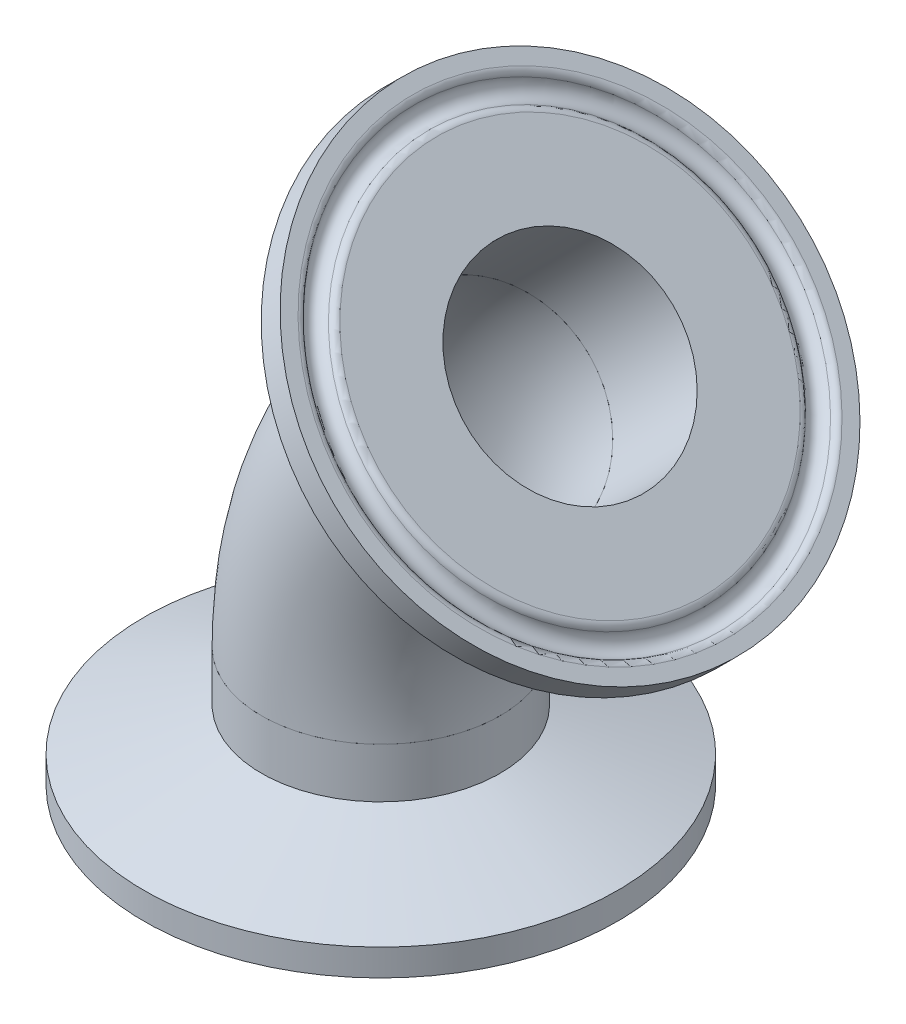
ISO-10303-21;
HEADER;
FILE_DESCRIPTION(('STEP AP214'),'2;1');
FILE_NAME('part.step','',(''),(''),'','','');
FILE_SCHEMA(('AUTOMOTIVE_DESIGN { 1 0 10303 214 1 1 1 1 }'));
ENDSEC;
DATA;
#1=APPLICATION_CONTEXT('core data for automotive mechanical design processes');
#2=APPLICATION_PROTOCOL_DEFINITION('international standard','automotive_design',2000,#1);
#3=PRODUCT_CONTEXT('',#1,'mechanical');
#4=PRODUCT('Part','Part','',(#3));
#5=PRODUCT_RELATED_PRODUCT_CATEGORY('part','',(#4));
#6=PRODUCT_DEFINITION_FORMATION('','',#4);
#7=PRODUCT_DEFINITION_CONTEXT('part definition',#1,'design');
#8=PRODUCT_DEFINITION('design','',#6,#7);
#9=PRODUCT_DEFINITION_SHAPE('','',#8);
#10=(LENGTH_UNIT() NAMED_UNIT(*) SI_UNIT(.MILLI.,.METRE.));
#11=(NAMED_UNIT(*) PLANE_ANGLE_UNIT() SI_UNIT($,.RADIAN.));
#12=(NAMED_UNIT(*) SI_UNIT($,.STERADIAN.) SOLID_ANGLE_UNIT());
#13=UNCERTAINTY_MEASURE_WITH_UNIT(LENGTH_MEASURE(1.E-05),#10,'distance_accuracy_value','');
#14=(GEOMETRIC_REPRESENTATION_CONTEXT(3) GLOBAL_UNCERTAINTY_ASSIGNED_CONTEXT((#13)) GLOBAL_UNIT_ASSIGNED_CONTEXT((#10,
#11,#12)) REPRESENTATION_CONTEXT('',''));
#15=CARTESIAN_POINT('',(0.,0.,0.));
#16=DIRECTION('',(0.,0.,1.));
#17=DIRECTION('',(1.,0.,0.));
#18=AXIS2_PLACEMENT_3D('',#15,#16,#17);
#19=CARTESIAN_POINT('',(21.1617274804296,38.7373016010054,24.153641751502));
#20=DIRECTION('',(0.707106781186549,0.707106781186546,0.));
#21=DIRECTION('',(0.534381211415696,-0.534381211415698,-0.654884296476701));
#22=AXIS2_PLACEMENT_3D('',#19,#20,#21);
#23=TOROIDAL_SURFACE('',#22,23.6366084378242,0.787399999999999);
#24=CARTESIAN_POINT('',(21.7185033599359,39.2940774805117,24.153641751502));
#25=DIRECTION('',(0.707106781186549,0.707106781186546,0.));
#26=DIRECTION('',(0.534381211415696,-0.534381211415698,-0.654884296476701));
#27=AXIS2_PLACEMENT_3D('',#24,#25,#26);
#28=CIRCLE('',#27,23.6366084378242);
#29=CARTESIAN_POINT('',(34.3494628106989,26.6631180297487,8.67439806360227));
#30=VERTEX_POINT('',#29);
#31=EDGE_CURVE('P0_E48',#30,#30,#28,.T.);
#32=ORIENTED_EDGE('',*,*,#31,.T.);
#33=EDGE_LOOP('',(#32));
#34=FACE_BOUND('',#33,.T.);
#35=CARTESIAN_POINT('',(21.3830102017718,38.9585843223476,24.153641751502));
#36=DIRECTION('',(0.707106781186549,0.707106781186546,0.));
#37=DIRECTION('',(0.534381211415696,-0.534381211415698,-0.654884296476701));
#38=AXIS2_PLACEMENT_3D('',#35,#36,#37);
#39=CIRCLE('',#38,22.9140666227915);
#40=CARTESIAN_POINT('',(33.6278568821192,26.7137376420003,9.14757935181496));
#41=VERTEX_POINT('',#40);
#42=EDGE_CURVE('P0_E9',#41,#41,#39,.T.);
#43=ORIENTED_EDGE('',*,*,#42,.F.);
#44=EDGE_LOOP('',(#43));
#45=FACE_BOUND('',#44,.T.);
#46=ADVANCED_FACE('P0_F14',(#34,#45),#23,.T.);
#47=CARTESIAN_POINT('',(21.7185033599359,39.2940774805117,24.153641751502));
#48=DIRECTION('',(0.707106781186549,0.707106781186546,0.));
#49=DIRECTION('',(0.534381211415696,-0.534381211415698,-0.654884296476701));
#50=AXIS2_PLACEMENT_3D('',#47,#48,#49);
#51=TOROIDAL_SURFACE('',#50,21.8186,1.1938);
#52=CARTESIAN_POINT('',(21.3830102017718,38.9585843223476,24.153641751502));
#53=DIRECTION('',(0.707106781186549,0.707106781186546,0.));
#54=DIRECTION('',(0.534381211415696,-0.534381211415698,-0.654884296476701));
#55=AXIS2_PLACEMENT_3D('',#52,#53,#54);
#56=CIRCLE('',#55,20.7231333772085);
#57=CARTESIAN_POINT('',(32.4570633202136,27.8845312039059,10.582387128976));
#58=VERTEX_POINT('',#57);
#59=EDGE_CURVE('P0_E20',#58,#58,#56,.T.);
#60=ORIENTED_EDGE('',*,*,#59,.F.);
#61=EDGE_LOOP('',(#60));
#62=FACE_BOUND('',#61,.T.);
#63=ORIENTED_EDGE('',*,*,#42,.T.);
#64=EDGE_LOOP('',(#63));
#65=FACE_BOUND('',#64,.T.);
#66=ADVANCED_FACE('P0_F97',(#62,#65),#51,.F.);
#67=CARTESIAN_POINT('',(21.1617274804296,38.7373016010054,24.153641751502));
#68=DIRECTION('',(0.707106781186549,0.707106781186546,0.));
#69=DIRECTION('',(0.534381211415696,-0.534381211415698,-0.654884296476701));
#70=AXIS2_PLACEMENT_3D('',#67,#68,#69);
#71=TOROIDAL_SURFACE('',#70,20.0005915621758,0.787399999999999);
#72=ORIENTED_EDGE('',*,*,#59,.T.);
#73=EDGE_LOOP('',(#72));
#74=FACE_BOUND('',#73,.T.);
#75=CARTESIAN_POINT('',(21.7185033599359,39.2940774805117,24.153641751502));
#76=DIRECTION('',(0.707106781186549,0.707106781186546,0.));
#77=DIRECTION('',(0.534381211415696,-0.534381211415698,-0.654884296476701));
#78=AXIS2_PLACEMENT_3D('',#75,#76,#77);
#79=CIRCLE('',#78,20.0005915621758);
#80=CARTESIAN_POINT('',(32.406443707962,28.6061371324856,11.0555684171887));
#81=VERTEX_POINT('',#80);
#82=EDGE_CURVE('P0_E24',#81,#81,#79,.T.);
#83=ORIENTED_EDGE('',*,*,#82,.F.);
#84=EDGE_LOOP('',(#83));
#85=FACE_BOUND('',#84,.T.);
#86=ADVANCED_FACE('P0_F93',(#74,#85),#71,.T.);
#87=CARTESIAN_POINT('',(21.7185033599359,39.2940774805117,24.153641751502));
#88=DIRECTION('',(-0.707106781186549,-0.707106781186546,0.));
#89=DIRECTION('',(-0.534381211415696,0.534381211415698,0.654884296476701));
#90=AXIS2_PLACEMENT_3D('',#87,#88,#89);
#91=PLANE('',#90);
#92=CARTESIAN_POINT('',(21.7185033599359,39.2940774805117,24.153641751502));
#93=DIRECTION('',(0.707106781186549,0.707106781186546,0.));
#94=DIRECTION('',(0.534381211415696,-0.534381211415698,-0.654884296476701));
#95=AXIS2_PLACEMENT_3D('',#92,#93,#94);
#96=CIRCLE('',#95,11.049);
#97=CARTESIAN_POINT('',(27.6228813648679,33.3896994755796,16.917825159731));
#98=VERTEX_POINT('',#97);
#99=EDGE_CURVE('P0_E28',#98,#98,#96,.T.);
#100=ORIENTED_EDGE('',*,*,#99,.F.);
#101=EDGE_LOOP('',(#100));
#102=FACE_BOUND('',#101,.T.);
#103=ORIENTED_EDGE('',*,*,#82,.T.);
#104=EDGE_LOOP('',(#103));
#105=FACE_BOUND('',#104,.T.);
#106=ADVANCED_FACE('P0_F86',(#102,#105),#91,.F.);
#107=CARTESIAN_POINT('',(21.7185033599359,39.2940774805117,24.153641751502));
#108=DIRECTION('',(0.707106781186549,0.707106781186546,0.));
#109=DIRECTION('',(0.534381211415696,-0.534381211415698,-0.654884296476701));
#110=AXIS2_PLACEMENT_3D('',#107,#108,#109);
#111=CYLINDRICAL_SURFACE('',#110,11.049);
#112=ORIENTED_EDGE('',*,*,#99,.T.);
#113=EDGE_LOOP('',(#112));
#114=FACE_BOUND('',#113,.T.);
#115=CARTESIAN_POINT('',(12.7382472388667,30.3138213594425,24.153641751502));
#116=DIRECTION('',(0.707106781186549,0.707106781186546,0.));
#117=DIRECTION('',(0.534381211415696,-0.534381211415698,-0.654884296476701));
#118=AXIS2_PLACEMENT_3D('',#115,#116,#117);
#119=CIRCLE('',#118,11.049);
#120=CARTESIAN_POINT('',(18.6426252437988,24.4094433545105,16.917825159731));
#121=VERTEX_POINT('',#120);
#122=EDGE_CURVE('P0_E33',#121,#121,#119,.T.);
#123=ORIENTED_EDGE('',*,*,#122,.F.);
#124=EDGE_LOOP('',(#123));
#125=FACE_BOUND('',#124,.T.);
#126=ADVANCED_FACE('P0_F81',(#114,#125),#111,.F.);
#127=CARTESIAN_POINT('',(12.7382472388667,30.3138213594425,24.153641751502));
#128=DIRECTION('',(0.707106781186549,0.707106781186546,0.));
#129=DIRECTION('',(0.534381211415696,-0.534381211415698,-0.654884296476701));
#130=AXIS2_PLACEMENT_3D('',#127,#128,#129);
#131=PLANE('',#130);
#132=CARTESIAN_POINT('',(12.7382472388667,30.3138213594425,24.153641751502));
#133=DIRECTION('',(0.707106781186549,0.707106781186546,0.));
#134=DIRECTION('',(0.534381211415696,-0.534381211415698,-0.654884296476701));
#135=AXIS2_PLACEMENT_3D('',#132,#133,#134);
#136=CIRCLE('',#135,12.7);
#137=CARTESIAN_POINT('',(19.5248886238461,23.5271799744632,15.8366111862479));
#138=VERTEX_POINT('',#137);
#139=EDGE_CURVE('P0_E36',#138,#138,#136,.T.);
#140=ORIENTED_EDGE('',*,*,#139,.F.);
#141=EDGE_LOOP('',(#140));
#142=FACE_BOUND('',#141,.T.);
#143=ORIENTED_EDGE('',*,*,#122,.T.);
#144=EDGE_LOOP('',(#143));
#145=FACE_BOUND('',#144,.T.);
#146=ADVANCED_FACE('P0_F75',(#142,#145),#131,.F.);
#147=CARTESIAN_POINT('',(21.7185033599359,39.2940774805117,24.153641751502));
#148=DIRECTION('',(0.707106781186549,0.707106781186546,0.));
#149=DIRECTION('',(0.534381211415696,-0.534381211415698,-0.654884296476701));
#150=AXIS2_PLACEMENT_3D('',#147,#148,#149);
#151=CYLINDRICAL_SURFACE('',#150,12.7);
#152=CARTESIAN_POINT('',(16.4906767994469,34.0662509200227,24.153641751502));
#153=DIRECTION('',(0.707106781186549,0.707106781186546,0.));
#154=DIRECTION('',(0.534381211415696,-0.534381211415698,-0.654884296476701));
#155=AXIS2_PLACEMENT_3D('',#152,#153,#154);
#156=CIRCLE('',#155,12.7);
#157=CARTESIAN_POINT('',(23.2773181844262,27.2796095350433,15.8366111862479));
#158=VERTEX_POINT('',#157);
#159=EDGE_CURVE('P0_E39',#158,#158,#156,.T.);
#160=ORIENTED_EDGE('',*,*,#159,.F.);
#161=EDGE_LOOP('',(#160));
#162=FACE_BOUND('',#161,.T.);
#163=ORIENTED_EDGE('',*,*,#139,.T.);
#164=EDGE_LOOP('',(#163));
#165=FACE_BOUND('',#164,.T.);
#166=ADVANCED_FACE('P0_F69',(#162,#165),#151,.T.);
#167=CARTESIAN_POINT('',(16.4906767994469,34.0662509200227,24.153641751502));
#168=DIRECTION('',(0.707106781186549,0.707106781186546,0.));
#169=DIRECTION('',(0.534381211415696,-0.534381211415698,-0.654884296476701));
#170=AXIS2_PLACEMENT_3D('',#167,#168,#169);
#171=CONICAL_SURFACE('',#170,12.7,1.22173047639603);
#172=CARTESIAN_POINT('',(19.7069259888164,37.2825001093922,24.153641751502));
#173=DIRECTION('',(0.707106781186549,0.707106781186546,0.));
#174=DIRECTION('',(0.534381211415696,-0.534381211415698,-0.654884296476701));
#175=AXIS2_PLACEMENT_3D('',#172,#173,#174);
#176=CIRCLE('',#175,25.1968);
#177=CARTESIAN_POINT('',(33.1716224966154,23.8178036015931,7.65265311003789));
#178=VERTEX_POINT('',#177);
#179=EDGE_CURVE('P0_E42',#178,#178,#176,.T.);
#180=ORIENTED_EDGE('',*,*,#179,.F.);
#181=EDGE_LOOP('',(#180));
#182=FACE_BOUND('',#181,.T.);
#183=ORIENTED_EDGE('',*,*,#159,.T.);
#184=EDGE_LOOP('',(#183));
#185=FACE_BOUND('',#184,.T.);
#186=ADVANCED_FACE('P0_F63',(#182,#185),#171,.T.);
#187=CARTESIAN_POINT('',(21.7185033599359,39.2940774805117,24.153641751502));
#188=DIRECTION('',(0.707106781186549,0.707106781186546,0.));
#189=DIRECTION('',(0.534381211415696,-0.534381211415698,-0.654884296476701));
#190=AXIS2_PLACEMENT_3D('',#187,#188,#189);
#191=CYLINDRICAL_SURFACE('',#190,25.1968);
#192=CARTESIAN_POINT('',(21.7185033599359,39.2940774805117,24.153641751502));
#193=DIRECTION('',(0.707106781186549,0.707106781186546,0.));
#194=DIRECTION('',(0.534381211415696,-0.534381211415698,-0.654884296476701));
#195=AXIS2_PLACEMENT_3D('',#192,#193,#194);
#196=CIRCLE('',#195,25.1968);
#197=CARTESIAN_POINT('',(35.1831998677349,25.8293809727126,7.65265311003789));
#198=VERTEX_POINT('',#197);
#199=EDGE_CURVE('P0_E45',#198,#198,#196,.T.);
#200=ORIENTED_EDGE('',*,*,#199,.F.);
#201=EDGE_LOOP('',(#200));
#202=FACE_BOUND('',#201,.T.);
#203=ORIENTED_EDGE('',*,*,#179,.T.);
#204=EDGE_LOOP('',(#203));
#205=FACE_BOUND('',#204,.T.);
#206=ADVANCED_FACE('P0_F57',(#202,#205),#191,.T.);
#207=CARTESIAN_POINT('',(21.7185033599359,39.2940774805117,24.153641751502));
#208=DIRECTION('',(-0.707106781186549,-0.707106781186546,0.));
#209=DIRECTION('',(-0.534381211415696,0.534381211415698,0.654884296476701));
#210=AXIS2_PLACEMENT_3D('',#207,#208,#209);
#211=PLANE('',#210);
#212=ORIENTED_EDGE('',*,*,#31,.F.);
#213=EDGE_LOOP('',(#212));
#214=FACE_BOUND('',#213,.T.);
#215=ORIENTED_EDGE('',*,*,#199,.T.);
#216=EDGE_LOOP('',(#215));
#217=FACE_BOUND('',#216,.T.);
#218=ADVANCED_FACE('P0_F54',(#214,#217),#211,.F.);
#219=CLOSED_SHELL('',(#46,#66,#86,#106,#126,#146,#166,#186,#206,#218));
#220=MANIFOLD_SOLID_BREP('P0_B1',#219);
#221=CARTESIAN_POINT('',(1.57901560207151,-8.53954700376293,24.153641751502));
#222=DIRECTION('',(0.,-1.,0.));
#223=DIRECTION('',(0.,0.,-1.));
#224=AXIS2_PLACEMENT_3D('',#221,#222,#223);
#225=TOROIDAL_SURFACE('',#224,23.6366084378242,0.787399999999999);
#226=CARTESIAN_POINT('',(1.57901560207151,-9.32694700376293,24.153641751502));
#227=DIRECTION('',(0.,-1.,0.));
#228=DIRECTION('',(0.,0.,-1.));
#229=AXIS2_PLACEMENT_3D('',#226,#227,#228);
#230=CIRCLE('',#229,23.6366084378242);
#231=CARTESIAN_POINT('',(1.57901560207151,-9.32694700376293,0.51703331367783));
#232=VERTEX_POINT('',#231);
#233=EDGE_CURVE('P1_E49',#232,#232,#230,.T.);
#234=ORIENTED_EDGE('',*,*,#233,.T.);
#235=EDGE_LOOP('',(#234));
#236=FACE_BOUND('',#235,.T.);
#237=CARTESIAN_POINT('',(1.57901560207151,-8.85248802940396,24.153641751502));
#238=DIRECTION('',(0.,-1.,0.));
#239=DIRECTION('',(0.,0.,-1.));
#240=AXIS2_PLACEMENT_3D('',#237,#238,#239);
#241=CIRCLE('',#240,22.9140666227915);
#242=CARTESIAN_POINT('',(1.57901560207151,-8.85248802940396,1.23957512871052));
#243=VERTEX_POINT('',#242);
#244=EDGE_CURVE('P1_E10',#243,#243,#241,.T.);
#245=ORIENTED_EDGE('',*,*,#244,.F.);
#246=EDGE_LOOP('',(#245));
#247=FACE_BOUND('',#246,.T.);
#248=ADVANCED_FACE('P1_F15',(#236,#247),#225,.T.);
#249=CARTESIAN_POINT('',(1.57901560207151,-9.32694700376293,24.153641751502));
#250=DIRECTION('',(0.,-1.,0.));
#251=DIRECTION('',(0.,0.,-1.));
#252=AXIS2_PLACEMENT_3D('',#249,#250,#251);
#253=TOROIDAL_SURFACE('',#252,21.8186,1.1938);
#254=CARTESIAN_POINT('',(1.57901560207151,-8.85248802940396,24.153641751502));
#255=DIRECTION('',(0.,-1.,0.));
#256=DIRECTION('',(0.,0.,-1.));
#257=AXIS2_PLACEMENT_3D('',#254,#255,#256);
#258=CIRCLE('',#257,20.7231333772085);
#259=CARTESIAN_POINT('',(1.57901560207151,-8.85248802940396,3.43050837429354));
#260=VERTEX_POINT('',#259);
#261=EDGE_CURVE('P1_E21',#260,#260,#258,.T.);
#262=ORIENTED_EDGE('',*,*,#261,.F.);
#263=EDGE_LOOP('',(#262));
#264=FACE_BOUND('',#263,.T.);
#265=ORIENTED_EDGE('',*,*,#244,.T.);
#266=EDGE_LOOP('',(#265));
#267=FACE_BOUND('',#266,.T.);
#268=ADVANCED_FACE('P1_F98',(#264,#267),#253,.F.);
#269=CARTESIAN_POINT('',(1.57901560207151,-8.53954700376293,24.153641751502));
#270=DIRECTION('',(0.,-1.,0.));
#271=DIRECTION('',(0.,0.,-1.));
#272=AXIS2_PLACEMENT_3D('',#269,#270,#271);
#273=TOROIDAL_SURFACE('',#272,20.0005915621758,0.787399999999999);
#274=ORIENTED_EDGE('',*,*,#261,.T.);
#275=EDGE_LOOP('',(#274));
#276=FACE_BOUND('',#275,.T.);
#277=CARTESIAN_POINT('',(1.57901560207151,-9.32694700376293,24.153641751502));
#278=DIRECTION('',(0.,-1.,0.));
#279=DIRECTION('',(0.,0.,-1.));
#280=AXIS2_PLACEMENT_3D('',#277,#278,#279);
#281=CIRCLE('',#280,20.0005915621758);
#282=CARTESIAN_POINT('',(1.57901560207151,-9.32694700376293,4.15305018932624));
#283=VERTEX_POINT('',#282);
#284=EDGE_CURVE('P1_E25',#283,#283,#281,.T.);
#285=ORIENTED_EDGE('',*,*,#284,.F.);
#286=EDGE_LOOP('',(#285));
#287=FACE_BOUND('',#286,.T.);
#288=ADVANCED_FACE('P1_F94',(#276,#287),#273,.T.);
#289=CARTESIAN_POINT('',(1.57901560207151,-9.32694700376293,24.153641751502));
#290=DIRECTION('',(0.,1.,0.));
#291=DIRECTION('',(0.,0.,1.));
#292=AXIS2_PLACEMENT_3D('',#289,#290,#291);
#293=PLANE('',#292);
#294=CARTESIAN_POINT('',(1.57901560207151,-9.32694700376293,24.153641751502));
#295=DIRECTION('',(0.,-1.,0.));
#296=DIRECTION('',(0.,0.,-1.));
#297=AXIS2_PLACEMENT_3D('',#294,#295,#296);
#298=CIRCLE('',#297,11.049);
#299=CARTESIAN_POINT('',(1.57901560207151,-9.32694700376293,13.104641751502));
#300=VERTEX_POINT('',#299);
#301=EDGE_CURVE('P1_E29',#300,#300,#298,.T.);
#302=ORIENTED_EDGE('',*,*,#301,.F.);
#303=EDGE_LOOP('',(#302));
#304=FACE_BOUND('',#303,.T.);
#305=ORIENTED_EDGE('',*,*,#284,.T.);
#306=EDGE_LOOP('',(#305));
#307=FACE_BOUND('',#306,.T.);
#308=ADVANCED_FACE('P1_F87',(#304,#307),#293,.F.);
#309=CARTESIAN_POINT('',(1.57901560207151,-9.32694700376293,24.153641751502));
#310=DIRECTION('',(0.,-1.,0.));
#311=DIRECTION('',(0.,0.,-1.));
#312=AXIS2_PLACEMENT_3D('',#309,#310,#311);
#313=CYLINDRICAL_SURFACE('',#312,11.049);
#314=ORIENTED_EDGE('',*,*,#301,.T.);
#315=EDGE_LOOP('',(#314));
#316=FACE_BOUND('',#315,.T.);
#317=CARTESIAN_POINT('',(1.57901560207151,3.37305299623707,24.153641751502));
#318=DIRECTION('',(0.,-1.,0.));
#319=DIRECTION('',(0.,0.,-1.));
#320=AXIS2_PLACEMENT_3D('',#317,#318,#319);
#321=CIRCLE('',#320,11.049);
#322=CARTESIAN_POINT('',(1.57901560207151,3.37305299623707,13.104641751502));
#323=VERTEX_POINT('',#322);
#324=EDGE_CURVE('P1_E34',#323,#323,#321,.T.);
#325=ORIENTED_EDGE('',*,*,#324,.F.);
#326=EDGE_LOOP('',(#325));
#327=FACE_BOUND('',#326,.T.);
#328=ADVANCED_FACE('P1_F82',(#316,#327),#313,.F.);
#329=CARTESIAN_POINT('',(1.57901560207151,3.37305299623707,24.153641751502));
#330=DIRECTION('',(0.,-1.,0.));
#331=DIRECTION('',(0.,0.,-1.));
#332=AXIS2_PLACEMENT_3D('',#329,#330,#331);
#333=PLANE('',#332);
#334=CARTESIAN_POINT('',(1.57901560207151,3.37305299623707,24.153641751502));
#335=DIRECTION('',(0.,-1.,0.));
#336=DIRECTION('',(0.,0.,-1.));
#337=AXIS2_PLACEMENT_3D('',#334,#335,#336);
#338=CIRCLE('',#337,12.7);
#339=CARTESIAN_POINT('',(1.57901560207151,3.37305299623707,11.453641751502));
#340=VERTEX_POINT('',#339);
#341=EDGE_CURVE('P1_E37',#340,#340,#338,.T.);
#342=ORIENTED_EDGE('',*,*,#341,.F.);
#343=EDGE_LOOP('',(#342));
#344=FACE_BOUND('',#343,.T.);
#345=ORIENTED_EDGE('',*,*,#324,.T.);
#346=EDGE_LOOP('',(#345));
#347=FACE_BOUND('',#346,.T.);
#348=ADVANCED_FACE('P1_F76',(#344,#347),#333,.F.);
#349=CARTESIAN_POINT('',(1.57901560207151,-9.32694700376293,24.153641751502));
#350=DIRECTION('',(0.,-1.,0.));
#351=DIRECTION('',(0.,0.,-1.));
#352=AXIS2_PLACEMENT_3D('',#349,#350,#351);
#353=CYLINDRICAL_SURFACE('',#352,12.7);
#354=CARTESIAN_POINT('',(1.57901560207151,-1.93368378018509,24.153641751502));
#355=DIRECTION('',(0.,-1.,0.));
#356=DIRECTION('',(0.,0.,-1.));
#357=AXIS2_PLACEMENT_3D('',#354,#355,#356);
#358=CIRCLE('',#357,12.7);
#359=CARTESIAN_POINT('',(1.57901560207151,-1.93368378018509,11.453641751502));
#360=VERTEX_POINT('',#359);
#361=EDGE_CURVE('P1_E40',#360,#360,#358,.T.);
#362=ORIENTED_EDGE('',*,*,#361,.F.);
#363=EDGE_LOOP('',(#362));
#364=FACE_BOUND('',#363,.T.);
#365=ORIENTED_EDGE('',*,*,#341,.T.);
#366=EDGE_LOOP('',(#365));
#367=FACE_BOUND('',#366,.T.);
#368=ADVANCED_FACE('P1_F70',(#364,#367),#353,.T.);
#369=CARTESIAN_POINT('',(1.57901560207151,-1.93368378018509,24.153641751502));
#370=DIRECTION('',(0.,-1.,0.));
#371=DIRECTION('',(0.,0.,-1.));
#372=AXIS2_PLACEMENT_3D('',#369,#370,#371);
#373=CONICAL_SURFACE('',#372,12.7,1.22173047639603);
#374=CARTESIAN_POINT('',(1.57901560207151,-6.48214700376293,24.153641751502));
#375=DIRECTION('',(0.,-1.,0.));
#376=DIRECTION('',(0.,0.,-1.));
#377=AXIS2_PLACEMENT_3D('',#374,#375,#376);
#378=CIRCLE('',#377,25.1968);
#379=CARTESIAN_POINT('',(1.57901560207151,-6.48214700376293,-1.04315824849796));
#380=VERTEX_POINT('',#379);
#381=EDGE_CURVE('P1_E43',#380,#380,#378,.T.);
#382=ORIENTED_EDGE('',*,*,#381,.F.);
#383=EDGE_LOOP('',(#382));
#384=FACE_BOUND('',#383,.T.);
#385=ORIENTED_EDGE('',*,*,#361,.T.);
#386=EDGE_LOOP('',(#385));
#387=FACE_BOUND('',#386,.T.);
#388=ADVANCED_FACE('P1_F64',(#384,#387),#373,.T.);
#389=CARTESIAN_POINT('',(1.57901560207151,-9.32694700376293,24.153641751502));
#390=DIRECTION('',(0.,-1.,0.));
#391=DIRECTION('',(0.,0.,-1.));
#392=AXIS2_PLACEMENT_3D('',#389,#390,#391);
#393=CYLINDRICAL_SURFACE('',#392,25.1968);
#394=CARTESIAN_POINT('',(1.57901560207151,-9.32694700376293,24.153641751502));
#395=DIRECTION('',(0.,-1.,0.));
#396=DIRECTION('',(0.,0.,-1.));
#397=AXIS2_PLACEMENT_3D('',#394,#395,#396);
#398=CIRCLE('',#397,25.1968);
#399=CARTESIAN_POINT('',(1.57901560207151,-9.32694700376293,-1.04315824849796));
#400=VERTEX_POINT('',#399);
#401=EDGE_CURVE('P1_E46',#400,#400,#398,.T.);
#402=ORIENTED_EDGE('',*,*,#401,.F.);
#403=EDGE_LOOP('',(#402));
#404=FACE_BOUND('',#403,.T.);
#405=ORIENTED_EDGE('',*,*,#381,.T.);
#406=EDGE_LOOP('',(#405));
#407=FACE_BOUND('',#406,.T.);
#408=ADVANCED_FACE('P1_F58',(#404,#407),#393,.T.);
#409=CARTESIAN_POINT('',(1.57901560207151,-9.32694700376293,24.153641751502));
#410=DIRECTION('',(0.,1.,0.));
#411=DIRECTION('',(0.,0.,1.));
#412=AXIS2_PLACEMENT_3D('',#409,#410,#411);
#413=PLANE('',#412);
#414=ORIENTED_EDGE('',*,*,#233,.F.);
#415=EDGE_LOOP('',(#414));
#416=FACE_BOUND('',#415,.T.);
#417=ORIENTED_EDGE('',*,*,#401,.T.);
#418=EDGE_LOOP('',(#417));
#419=FACE_BOUND('',#418,.T.);
#420=ADVANCED_FACE('P1_F55',(#416,#419),#413,.F.);
#421=CLOSED_SHELL('',(#248,#268,#288,#308,#328,#348,#368,#388,#408,#420));
#422=MANIFOLD_SOLID_BREP('P1_B1',#421);
#423=CARTESIAN_POINT('',(39.6790156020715,3.37305299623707,24.153641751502));
#424=DIRECTION('',(0.,0.,1.));
#425=DIRECTION('',(1.00000000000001,0.,0.));
#426=AXIS2_PLACEMENT_3D('',#423,#424,#425);
#427=TOROIDAL_SURFACE('',#426,38.1,12.7);
#428=CARTESIAN_POINT('',(12.7382472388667,30.3138213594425,24.153641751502));
#429=DIRECTION('',(0.707106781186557,0.707106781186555,0.));
#430=DIRECTION('',(0.,0.,1.));
#431=AXIS2_PLACEMENT_3D('',#428,#429,#430);
#432=CIRCLE('',#431,12.7);
#433=CARTESIAN_POINT('',(3.75799111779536,39.2940774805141,24.153641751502));
#434=VERTEX_POINT('',#433);
#435=EDGE_CURVE('P2_E10',#434,#434,#432,.T.);
#436=CARTESIAN_POINT('',(1.57901560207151,3.37305299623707,24.153641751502));
#437=DIRECTION('',(0.,1.00000000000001,0.));
#438=DIRECTION('',(0.,0.,1.));
#439=AXIS2_PLACEMENT_3D('',#436,#437,#438);
#440=CIRCLE('',#439,12.7);
#441=CARTESIAN_POINT('',(-11.1209843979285,3.37305299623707,24.153641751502));
#442=VERTEX_POINT('',#441);
#443=EDGE_CURVE('P2_E21',#442,#442,#440,.T.);
#444=CARTESIAN_POINT('',(39.6790156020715,3.37305299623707,24.153641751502));
#445=DIRECTION('',(0.,0.,1.));
#446=DIRECTION('',(1.00000000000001,0.,0.));
#447=AXIS2_PLACEMENT_3D('',#444,#445,#446);
#448=CIRCLE('',#447,50.8);
#449=EDGE_CURVE('',#434,#442,#448,.T.);
#450=ORIENTED_EDGE('',*,*,#435,.F.);
#451=ORIENTED_EDGE('',*,*,#443,.T.);
#452=ORIENTED_EDGE('',*,*,#449,.T.);
#453=ORIENTED_EDGE('',*,*,#449,.F.);
#454=EDGE_LOOP('',(#450,#452,#451,#453));
#455=FACE_BOUND('',#454,.T.);
#456=ADVANCED_FACE('P2_F15',(#455),#427,.T.);
#457=CARTESIAN_POINT('',(12.7382472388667,30.3138213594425,24.153641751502));
#458=DIRECTION('',(0.707106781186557,0.707106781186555,0.));
#459=DIRECTION('',(0.,0.,1.));
#460=AXIS2_PLACEMENT_3D('',#457,#458,#459);
#461=PLANE('',#460);
#462=CARTESIAN_POINT('',(12.7382472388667,30.3138213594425,24.153641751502));
#463=DIRECTION('',(0.707106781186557,0.707106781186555,0.));
#464=DIRECTION('',(-0.707106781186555,0.707106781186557,0.));
#465=AXIS2_PLACEMENT_3D('',#462,#463,#464);
#466=CIRCLE('',#465,11.049);
#467=CARTESIAN_POINT('',(4.92542441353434,38.1266441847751,24.153641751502));
#468=VERTEX_POINT('',#467);
#469=EDGE_CURVE('P2_E25',#468,#468,#466,.T.);
#470=ORIENTED_EDGE('',*,*,#469,.F.);
#471=EDGE_LOOP('',(#470));
#472=FACE_BOUND('',#471,.T.);
#473=ORIENTED_EDGE('',*,*,#435,.T.);
#474=EDGE_LOOP('',(#473));
#475=FACE_BOUND('',#474,.T.);
#476=ADVANCED_FACE('P2_F46',(#472,#475),#461,.T.);
#477=CARTESIAN_POINT('',(1.57901560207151,3.37305299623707,24.153641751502));
#478=DIRECTION('',(0.,1.00000000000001,0.));
#479=DIRECTION('',(0.,0.,1.));
#480=AXIS2_PLACEMENT_3D('',#477,#478,#479);
#481=PLANE('',#480);
#482=CARTESIAN_POINT('',(1.57901560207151,3.37305299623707,24.153641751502));
#483=DIRECTION('',(0.,1.00000000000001,0.));
#484=DIRECTION('',(0.,0.,1.));
#485=AXIS2_PLACEMENT_3D('',#482,#483,#484);
#486=CIRCLE('',#485,11.049);
#487=CARTESIAN_POINT('',(-9.46998439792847,3.37305299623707,24.153641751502));
#488=VERTEX_POINT('',#487);
#489=EDGE_CURVE('P2_E29',#488,#488,#486,.T.);
#490=ORIENTED_EDGE('',*,*,#489,.T.);
#491=EDGE_LOOP('',(#490));
#492=FACE_BOUND('',#491,.T.);
#493=ORIENTED_EDGE('',*,*,#443,.F.);
#494=EDGE_LOOP('',(#493));
#495=FACE_BOUND('',#494,.T.);
#496=ADVANCED_FACE('P2_F35',(#492,#495),#481,.F.);
#497=CARTESIAN_POINT('',(39.6790156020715,3.37305299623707,24.153641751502));
#498=DIRECTION('',(0.,0.,1.));
#499=DIRECTION('',(1.00000000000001,0.,0.));
#500=AXIS2_PLACEMENT_3D('',#497,#498,#499);
#501=TOROIDAL_SURFACE('',#500,38.1,11.049);
#502=CARTESIAN_POINT('',(39.6790156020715,3.37305299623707,24.153641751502));
#503=DIRECTION('',(0.,0.,1.));
#504=DIRECTION('',(1.00000000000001,0.,0.));
#505=AXIS2_PLACEMENT_3D('',#502,#503,#504);
#506=CIRCLE('',#505,49.149);
#507=EDGE_CURVE('',#468,#488,#506,.T.);
#508=ORIENTED_EDGE('',*,*,#469,.T.);
#509=ORIENTED_EDGE('',*,*,#489,.F.);
#510=ORIENTED_EDGE('',*,*,#507,.T.);
#511=ORIENTED_EDGE('',*,*,#507,.F.);
#512=EDGE_LOOP('',(#508,#510,#509,#511));
#513=FACE_BOUND('',#512,.T.);
#514=ADVANCED_FACE('P2_F38',(#513),#501,.F.);
#515=CLOSED_SHELL('',(#456,#476,#496,#514));
#516=MANIFOLD_SOLID_BREP('P2_B1',#515);
#517=ADVANCED_BREP_SHAPE_REPRESENTATION('',(#18,#220,#422,#516),#14);
#518=SHAPE_DEFINITION_REPRESENTATION(#9,#517);
ENDSEC;
END-ISO-10303-21;
